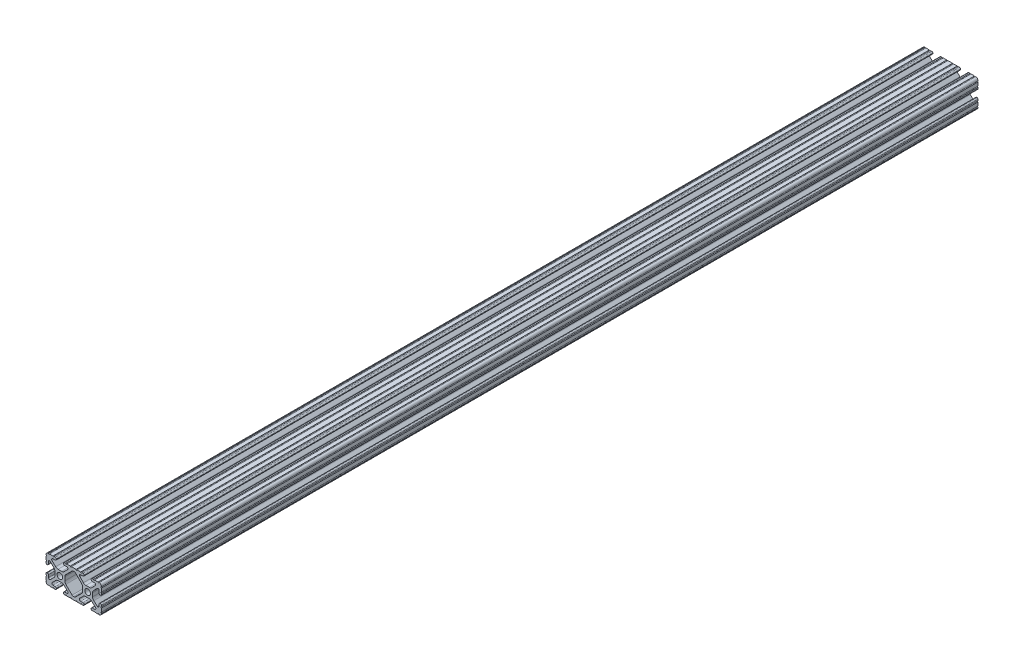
from build123d import *

# Parameters (mm, degrees)
SKETCH1_R           = 2.6035
BOSS_EXTRUDE1_DEPTH = 401.1295


with BuildPart() as part:
    # Sketch1 → Boss-Extrude1 (new, symmetric)
    with BuildSketch(Plane.XY):
        with BuildLine():
            Line((18.01710265, 12.7), (16.98745015, 12.7))
            ThreePointArc((16.98745015, 12.7), (16.245730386, 12.392769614), (15.9385, 11.65104985))
            Line((15.9385, 11.65104985), (15.9385, 11.53922))
            ThreePointArc((15.9385, 11.53922), (16.245750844, 10.797450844), (16.98752, 10.4902))
            Line((16.98752, 10.4902), (19.116384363, 10.4902))
            ThreePointArc((19.116384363, 10.4902), (20.052502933, 9.869096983), (19.844087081, 8.765172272))
            Line((19.844087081, 8.765172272), (16.618993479, 5.455112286))
            ThreePointArc((16.618993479, 5.455112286), (15.578994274, 4.745442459), (14.344932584, 4.4958))
            Line((14.344932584, 4.4958), (11.083317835, 4.4958))
            ThreePointArc((11.083317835, 4.4958), (9.854330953, 4.743306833), (8.816955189, 5.447238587))
            Line((8.816955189, 5.447238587), (5.564154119, 8.762652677))
            ThreePointArc((5.564154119, 8.762652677), (5.352591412, 9.867473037), (6.289393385, 10.4902))
            Line((6.289393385, 10.4902), (8.41248, 10.4902))
            ThreePointArc((8.41248, 10.4902), (9.154249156, 10.797450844), (9.4615, 11.53922))
            Line((9.4615, 11.53922), (9.4615, 11.65104985))
            ThreePointArc((9.4615, 11.65104985), (9.154269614, 12.392769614), (8.41254985, 12.7))
            Line((8.41254985, 12.7), (7.38288465, 12.7))
            ThreePointArc((7.38288465, 12.7), (6.87488465, 12.192), (6.36688465, 12.7))
            Line((6.36688465, 12.7), (3.14958095, 12.7))
            ThreePointArc((3.14958095, 12.7), (2.64158095, 12.192), (2.13358095, 12.7))
            Line((2.13358095, 12.7), (-2.13358095, 12.7))
            ThreePointArc((-2.13358095, 12.7), (-2.64158095, 12.192), (-3.14958095, 12.7))
            Line((-3.14958095, 12.7), (-6.36689735, 12.7))
            ThreePointArc((-6.36689735, 12.7), (-6.87489735, 12.192), (-7.38289735, 12.7))
            Line((-7.38289735, 12.7), (-8.41254985, 12.7))
            ThreePointArc((-8.41254985, 12.7), (-9.154269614, 12.392769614), (-9.4615, 11.65104985))
            Line((-9.4615, 11.65104985), (-9.4615, 11.53922))
            ThreePointArc((-9.4615, 11.53922), (-9.154249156, 10.797450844), (-8.41248, 10.4902))
            Line((-8.41248, 10.4902), (-6.283641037, 10.4902))
            ThreePointArc((-6.283641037, 10.4902), (-5.297291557, 9.829633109), (-5.532576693, 8.666071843))
            Line((-5.532576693, 8.666071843), (-8.809985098, 5.416263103))
            ThreePointArc((-8.809985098, 5.416263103), (-9.836720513, 4.734920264), (-11.045536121, 4.4958))
            Line((-11.045536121, 4.4958), (-14.354463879, 4.4958))
            ThreePointArc((-14.354463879, 4.4958), (-15.563279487, 4.734920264), (-16.590014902, 5.416263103))
            Line((-16.590014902, 5.416263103), (-19.867423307, 8.666071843))
            ThreePointArc((-19.867423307, 8.666071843), (-20.102708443, 9.829633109), (-19.116358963, 10.4902))
            Line((-19.116358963, 10.4902), (-16.98752, 10.4902))
            ThreePointArc((-16.98752, 10.4902), (-16.245750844, 10.797450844), (-15.9385, 11.53922))
            Line((-15.9385, 11.53922), (-15.9385, 11.65104985))
            ThreePointArc((-15.9385, 11.65104985), (-16.245730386, 12.392769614), (-16.98745015, 12.7))
            Line((-16.98745015, 12.7), (-18.01711535, 12.7))
            ThreePointArc((-18.01711535, 12.7), (-18.52511535, 12.192), (-19.03311535, 12.7))
            Line((-19.03311535, 12.7), (-22.2504, 12.7))
            ThreePointArc((-22.2504, 12.7), (-22.758323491, 12.192000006), (-23.266399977, 12.699846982))
            ThreePointArc((-23.266399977, 12.699846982), (-24.782522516, 12.082522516), (-25.399846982, 10.566399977))
            ThreePointArc((-25.399846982, 10.566399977), (-24.892000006, 10.058323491), (-25.4, 9.5504))
            Line((-25.4, 9.5504), (-25.4, 6.3330836))
            ThreePointArc((-25.4, 6.3330836), (-24.892, 5.8250836), (-25.4, 5.3170836))
            Line((-25.4, 5.3170836), (-25.4, 4.237520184))
            ThreePointArc((-25.4, 4.237520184), (-25.107393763, 3.531106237), (-24.400979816, 3.2385))
            Line((-24.400979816, 3.2385), (-24.23922, 3.2385))
            ThreePointArc((-24.23922, 3.2385), (-23.497450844, 3.545750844), (-23.1902, 4.28752))
            Line((-23.1902, 4.28752), (-23.1902, 6.334741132))
            ThreePointArc((-23.1902, 6.334741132), (-22.556026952, 7.286023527), (-21.434002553, 7.066535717))
            Line((-21.434002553, 7.066535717), (-18.147950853, 3.808156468))
            ThreePointArc((-18.147950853, 3.808156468), (-17.452759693, 2.774838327), (-17.208501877, 1.553619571))
            Line((-17.208501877, 1.553619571), (-17.208501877, -1.695179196))
            ThreePointArc((-17.208501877, -1.695179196), (-17.450738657, -2.911536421), (-18.140486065, -3.942289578))
            Line((-18.140486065, -3.942289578), (-21.431579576, -7.227386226))
            ThreePointArc((-21.431579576, -7.227386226), (-22.55444896, -7.449940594), (-23.1902, -6.498002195))
            Line((-23.1902, -6.498002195), (-23.1902, -4.28752))
            ThreePointArc((-23.1902, -4.28752), (-23.497450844, -3.545750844), (-24.23922, -3.2385))
            Line((-24.23922, -3.2385), (-24.35098, -3.2385))
            ThreePointArc((-24.35098, -3.2385), (-25.092749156, -3.545750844), (-25.4, -4.28752))
            Line((-25.4, -4.28752), (-25.4, -5.3171344))
            ThreePointArc((-25.4, -5.3171344), (-24.892, -5.8251344), (-25.4, -6.3331344))
            Line((-25.4, -6.3331344), (-25.4, -9.5504))
            ThreePointArc((-25.4, -9.5504), (-24.892000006, -10.058323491), (-25.399846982, -10.566399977))
            ThreePointArc((-25.399846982, -10.566399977), (-24.782522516, -12.082522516), (-23.266399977, -12.699846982))
            ThreePointArc((-23.266399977, -12.699846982), (-22.758323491, -12.192000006), (-22.2504, -12.7))
            Line((-22.2504, -12.7), (-19.03308995, -12.7))
            ThreePointArc((-19.03308995, -12.7), (-18.52508995, -12.192), (-18.01708995, -12.7))
            Line((-18.01708995, -12.7), (-16.9874692, -12.7))
            ThreePointArc((-16.9874692, -12.7), (-16.245700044, -12.392749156), (-15.9384492, -11.65098))
            Line((-15.9384492, -11.65098), (-15.9384492, -11.53922))
            ThreePointArc((-15.9384492, -11.53922), (-16.245700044, -10.797450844), (-16.9874692, -10.4902))
            Line((-16.9874692, -10.4902), (-19.116358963, -10.4902))
            ThreePointArc((-19.116358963, -10.4902), (-20.055197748, -9.862578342), (-19.834124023, -8.755124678))
            Line((-19.834124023, -8.755124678), (-16.49660751, -5.423689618))
            ThreePointArc((-16.49660751, -5.423689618), (-15.467274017, -4.736928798), (-14.253591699, -4.4958))
            Line((-14.253591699, -4.4958), (-11.146408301, -4.4958))
            ThreePointArc((-11.146408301, -4.4958), (-9.932725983, -4.736928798), (-8.90339249, -5.423689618))
            Line((-8.90339249, -5.423689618), (-5.565875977, -8.755124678))
            ThreePointArc((-5.565875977, -8.755124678), (-5.344802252, -9.862578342), (-6.283641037, -10.4902))
            Line((-6.283641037, -10.4902), (-8.4125308, -10.4902))
            ThreePointArc((-8.4125308, -10.4902), (-9.154299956, -10.797450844), (-9.4615508, -11.53922))
            Line((-9.4615508, -11.53922), (-9.4615508, -11.65098))
            ThreePointArc((-9.4615508, -11.65098), (-9.154299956, -12.392749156), (-8.4125308, -12.7))
            Line((-8.4125308, -12.7), (-7.38287195, -12.7))
            ThreePointArc((-7.38287195, -12.7), (-6.87487195, -12.192), (-6.36687195, -12.7))
            Line((-6.36687195, -12.7), (-3.14960635, -12.7))
            ThreePointArc((-3.14960635, -12.7), (-2.64160635, -12.192), (-2.13360635, -12.7))
            Line((-2.13360635, -12.7), (2.13360635, -12.7))
            ThreePointArc((2.13360635, -12.7), (2.64159365, -12.1920127), (3.14958095, -12.7))
            Line((3.14958095, -12.7), (6.36691005, -12.7))
            ThreePointArc((6.36691005, -12.7), (6.87491005, -12.192), (7.38291005, -12.7))
            Line((7.38291005, -12.7), (8.4125308, -12.7))
            ThreePointArc((8.4125308, -12.7), (9.154299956, -12.392749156), (9.4615508, -11.65098))
            Line((9.4615508, -11.65098), (9.4615508, -11.53922))
            ThreePointArc((9.4615508, -11.53922), (9.154299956, -10.797450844), (8.4125308, -10.4902))
            Line((8.4125308, -10.4902), (6.289393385, -10.4902))
            ThreePointArc((6.289393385, -10.4902), (5.231590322, -9.783049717), (5.480677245, -8.535265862))
            Line((5.480677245, -8.535265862), (8.597933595, -5.423689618))
            ThreePointArc((8.597933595, -5.423689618), (9.627267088, -4.736928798), (10.840949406, -4.4958))
            Line((10.840949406, -4.4958), (14.102564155, -4.4958))
            ThreePointArc((14.102564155, -4.4958), (15.215927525, -4.697410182), (16.187895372, -5.276636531))
            Line((16.187895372, -5.276636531), (19.868247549, -8.482246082))
            ThreePointArc((19.868247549, -8.482246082), (20.188435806, -9.746879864), (19.116384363, -10.4902))
            Line((19.116384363, -10.4902), (16.9874692, -10.4902))
            ThreePointArc((16.9874692, -10.4902), (16.245700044, -10.797450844), (15.9384492, -11.53922))
            Line((15.9384492, -11.53922), (15.9384492, -11.65098))
            ThreePointArc((15.9384492, -11.65098), (16.245700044, -12.392749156), (16.9874692, -12.7))
            Line((16.9874692, -12.7), (18.01710265, -12.7))
            ThreePointArc((18.01710265, -12.7), (18.52510265, -12.192), (19.03310265, -12.7))
            Line((19.03310265, -12.7), (22.2504, -12.7))
            ThreePointArc((22.2504, -12.7), (22.758323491, -12.192000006), (23.266399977, -12.699846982))
            ThreePointArc((23.266399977, -12.699846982), (24.782522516, -12.082522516), (25.399846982, -10.566399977))
            ThreePointArc((25.399846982, -10.566399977), (24.892000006, -10.058323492), (25.4, -9.550400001))
            Line((25.4, -9.550400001), (25.4, -6.333083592))
            ThreePointArc((25.4, -6.333083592), (24.892000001, -5.825083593), (25.4, -5.317083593))
            Line((25.4, -5.317083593), (25.4, -4.237520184))
            ThreePointArc((25.4, -4.237520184), (25.107393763, -3.531106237), (24.400979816, -3.2385))
            Line((24.400979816, -3.2385), (24.189220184, -3.2385))
            ThreePointArc((24.189220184, -3.2385), (23.482806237, -3.531106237), (23.1902, -4.237520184))
            Line((23.1902, -4.237520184), (23.1902, -6.155876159))
            ThreePointArc((23.1902, -6.155876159), (22.62232736, -7.038258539), (21.583974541, -6.886926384))
            Line((21.583974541, -6.886926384), (18.29817066, -4.024970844))
            ThreePointArc((18.29817066, -4.024970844), (17.493730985, -2.946044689), (17.208501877, -1.630807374))
            Line((17.208501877, -1.630807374), (17.208501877, 1.630807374))
            ThreePointArc((17.208501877, 1.630807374), (17.442348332, 2.82673414), (18.109440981, 3.846495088))
            Line((18.109440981, 3.846495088), (21.526346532, 7.353420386))
            ThreePointArc((21.526346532, 7.353420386), (22.585896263, 7.574939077), (23.1902, 6.676867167))
            Line((23.1902, 6.676867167), (23.1902, 4.237520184))
            ThreePointArc((23.1902, 4.237520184), (23.482806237, 3.531106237), (24.189220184, 3.2385))
            Line((24.189220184, 3.2385), (24.400979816, 3.2385))
            ThreePointArc((24.400979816, 3.2385), (25.107393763, 3.531106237), (25.4, 4.237520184))
            Line((25.4, 4.237520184), (25.4, 5.3170836))
            ThreePointArc((25.4, 5.3170836), (24.891949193, 5.825134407), (25.4, 6.333185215))
            Line((25.4, 6.333185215), (25.4, 9.550400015))
            ThreePointArc((25.4, 9.550400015), (24.892000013, 10.058323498), (25.399846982, 10.566399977))
            ThreePointArc((25.399846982, 10.566399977), (24.782522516, 12.082522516), (23.266399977, 12.699846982))
            ThreePointArc((23.266399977, 12.699846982), (22.758323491, 12.192000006), (22.2504, 12.7))
            Line((22.2504, 12.7), (19.03310265, 12.7))
            ThreePointArc((19.03310265, 12.7), (18.52510265, 12.192), (18.01710265, 12.7))
        make_face()
        with Locations((-12.7, 0)):
            Circle(SKETCH1_R, mode=Mode.SUBTRACT)
        with Locations((12.7, 0)):
            Circle(SKETCH1_R, mode=Mode.SUBTRACT)
        with BuildLine():
            Line((-7.259513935, -3.869413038), (-1.545748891, -9.572766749))
            ThreePointArc((-1.545748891, -9.572766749), (-1.035199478, -9.913400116), (-0.433213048, -10.033))
            Line((-0.433213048, -10.033), (0.433213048, -10.033))
            ThreePointArc((0.433213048, -10.033), (1.035199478, -9.913400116), (1.545748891, -9.572766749))
            Line((1.545748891, -9.572766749), (7.259513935, -3.869413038))
            ThreePointArc((7.259513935, -3.869413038), (7.949261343, -2.838659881), (8.191498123, -1.622302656))
            Line((8.191498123, -1.622302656), (8.191498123, 1.622302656))
            ThreePointArc((8.191498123, 1.622302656), (7.955573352, 2.823327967), (7.282860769, 3.845864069))
            Line((7.282860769, 3.845864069), (1.675572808, 9.561086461))
            ThreePointArc((1.675572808, 9.561086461), (1.161034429, 9.910236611), (0.551456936, 10.033))
            Line((0.551456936, 10.033), (-0.395199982, 10.033))
            ThreePointArc((-0.395199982, 10.033), (-0.994772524, 9.914396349), (-1.50403329, 9.576450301))
            Line((-1.50403329, 9.576450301), (-7.252049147, 3.876839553))
            ThreePointArc((-7.252049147, 3.876839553), (-7.947240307, 2.843521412), (-8.191498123, 1.622302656))
            Line((-8.191498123, 1.622302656), (-8.191498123, -1.622302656))
            ThreePointArc((-8.191498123, -1.622302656), (-7.949261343, -2.838659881), (-7.259513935, -3.869413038))
        make_face(mode=Mode.SUBTRACT)
    extrude(amount=BOSS_EXTRUDE1_DEPTH, both=True)


solid = part.part
